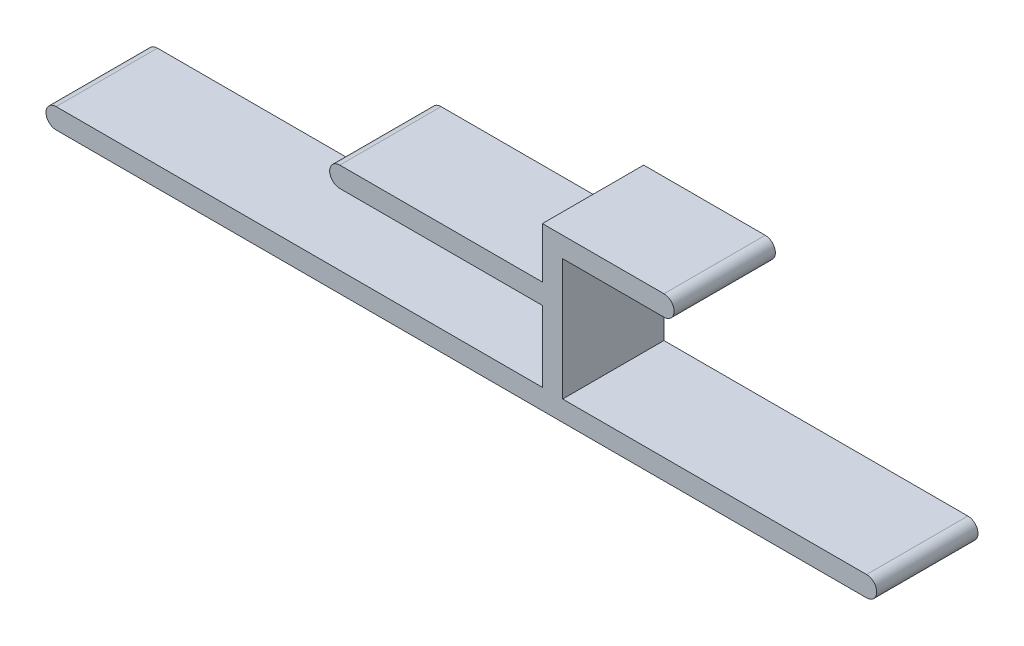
ISO-10303-21;
HEADER;
FILE_DESCRIPTION(('STEP AP214'),'2;1');
FILE_NAME('part.step','',(''),(''),'','','');
FILE_SCHEMA(('AUTOMOTIVE_DESIGN { 1 0 10303 214 1 1 1 1 }'));
ENDSEC;
DATA;
#1=APPLICATION_CONTEXT('core data for automotive mechanical design processes');
#2=APPLICATION_PROTOCOL_DEFINITION('international standard','automotive_design',2000,#1);
#3=PRODUCT_CONTEXT('',#1,'mechanical');
#4=PRODUCT('Part','Part','',(#3));
#5=PRODUCT_RELATED_PRODUCT_CATEGORY('part','',(#4));
#6=PRODUCT_DEFINITION_FORMATION('','',#4);
#7=PRODUCT_DEFINITION_CONTEXT('part definition',#1,'design');
#8=PRODUCT_DEFINITION('design','',#6,#7);
#9=PRODUCT_DEFINITION_SHAPE('','',#8);
#10=(LENGTH_UNIT() NAMED_UNIT(*) SI_UNIT(.MILLI.,.METRE.));
#11=(NAMED_UNIT(*) PLANE_ANGLE_UNIT() SI_UNIT($,.RADIAN.));
#12=(NAMED_UNIT(*) SI_UNIT($,.STERADIAN.) SOLID_ANGLE_UNIT());
#13=UNCERTAINTY_MEASURE_WITH_UNIT(LENGTH_MEASURE(1.E-05),#10,'distance_accuracy_value','');
#14=(GEOMETRIC_REPRESENTATION_CONTEXT(3) GLOBAL_UNCERTAINTY_ASSIGNED_CONTEXT((#13)) GLOBAL_UNIT_ASSIGNED_CONTEXT((#10,
#11,#12)) REPRESENTATION_CONTEXT('',''));
#15=CARTESIAN_POINT('',(0.,0.,0.));
#16=DIRECTION('',(0.,0.,1.));
#17=DIRECTION('',(1.,0.,0.));
#18=AXIS2_PLACEMENT_3D('',#15,#16,#17);
#19=CARTESIAN_POINT('',(-50.,-1.,10.));
#20=DIRECTION('',(0.,0.,-1.));
#21=DIRECTION('',(-1.,0.,0.));
#22=AXIS2_PLACEMENT_3D('',#19,#20,#21);
#23=CYLINDRICAL_SURFACE('',#22,1.);
#24=CARTESIAN_POINT('',(-50.,-1.,0.));
#25=DIRECTION('',(0.,0.,1.));
#26=DIRECTION('',(1.,0.,0.));
#27=AXIS2_PLACEMENT_3D('',#24,#25,#26);
#28=CIRCLE('',#27,1.);
#29=CARTESIAN_POINT('',(-50.,0.,0.));
#30=VERTEX_POINT('',#29);
#31=CARTESIAN_POINT('',(-50.,-2.,0.));
#32=VERTEX_POINT('',#31);
#33=EDGE_CURVE('E167',#30,#32,#28,.T.);
#34=ORIENTED_EDGE('',*,*,#33,.T.);
#35=DIRECTION('',(0.,0.,-1.));
#36=VECTOR('',#35,1.);
#37=CARTESIAN_POINT('',(-50.,-2.,10.));
#38=LINE('',#37,#36);
#39=CARTESIAN_POINT('',(-50.,-2.,10.));
#40=VERTEX_POINT('',#39);
#41=EDGE_CURVE('E11',#40,#32,#38,.T.);
#42=ORIENTED_EDGE('',*,*,#41,.F.);
#43=CARTESIAN_POINT('',(-50.,-1.,10.));
#44=DIRECTION('',(0.,0.,1.));
#45=DIRECTION('',(1.,0.,0.));
#46=AXIS2_PLACEMENT_3D('',#43,#44,#45);
#47=CIRCLE('',#46,1.);
#48=CARTESIAN_POINT('',(-50.,0.,10.));
#49=VERTEX_POINT('',#48);
#50=EDGE_CURVE('E193',#49,#40,#47,.T.);
#51=ORIENTED_EDGE('',*,*,#50,.F.);
#52=DIRECTION('',(0.,0.,-1.));
#53=VECTOR('',#52,1.);
#54=CARTESIAN_POINT('',(-50.,0.,10.));
#55=LINE('',#54,#53);
#56=EDGE_CURVE('E163',#49,#30,#55,.T.);
#57=ORIENTED_EDGE('',*,*,#56,.T.);
#58=EDGE_LOOP('',(#34,#42,#51,#57));
#59=FACE_BOUND('',#58,.T.);
#60=ADVANCED_FACE('F35',(#59),#23,.T.);
#61=CARTESIAN_POINT('',(-50.,-2.,10.));
#62=DIRECTION('',(0.,1.,0.));
#63=DIRECTION('',(0.,0.,1.));
#64=AXIS2_PLACEMENT_3D('',#61,#62,#63);
#65=PLANE('',#64);
#66=DIRECTION('',(1.,0.,0.));
#67=VECTOR('',#66,1.);
#68=CARTESIAN_POINT('',(-50.,-2.,0.));
#69=LINE('',#68,#67);
#70=CARTESIAN_POINT('',(30.,-2.,0.));
#71=VERTEX_POINT('',#70);
#72=EDGE_CURVE('E170',#32,#71,#69,.T.);
#73=ORIENTED_EDGE('',*,*,#72,.T.);
#74=DIRECTION('',(0.,0.,-1.));
#75=VECTOR('',#74,1.);
#76=CARTESIAN_POINT('',(30.,-2.,10.));
#77=LINE('',#76,#75);
#78=CARTESIAN_POINT('',(30.,-2.,10.));
#79=VERTEX_POINT('',#78);
#80=EDGE_CURVE('E43',#79,#71,#77,.T.);
#81=ORIENTED_EDGE('',*,*,#80,.F.);
#82=DIRECTION('',(1.,0.,0.));
#83=VECTOR('',#82,1.);
#84=CARTESIAN_POINT('',(-50.,-2.,10.));
#85=LINE('',#84,#83);
#86=EDGE_CURVE('E112',#40,#79,#85,.T.);
#87=ORIENTED_EDGE('',*,*,#86,.F.);
#88=ORIENTED_EDGE('',*,*,#41,.T.);
#89=EDGE_LOOP('',(#73,#81,#87,#88));
#90=FACE_BOUND('',#89,.T.);
#91=ADVANCED_FACE('F281',(#90),#65,.F.);
#92=CARTESIAN_POINT('',(30.,-0.999999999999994,10.));
#93=DIRECTION('',(0.,0.,-1.));
#94=DIRECTION('',(-1.,0.,0.));
#95=AXIS2_PLACEMENT_3D('',#92,#93,#94);
#96=CYLINDRICAL_SURFACE('',#95,1.00000000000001);
#97=CARTESIAN_POINT('',(30.,-0.999999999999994,0.));
#98=DIRECTION('',(0.,0.,1.));
#99=DIRECTION('',(-1.,0.,0.));
#100=AXIS2_PLACEMENT_3D('',#97,#98,#99);
#101=CIRCLE('',#100,1.00000000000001);
#102=CARTESIAN_POINT('',(30.,0.,0.));
#103=VERTEX_POINT('',#102);
#104=EDGE_CURVE('E172',#71,#103,#101,.T.);
#105=ORIENTED_EDGE('',*,*,#104,.T.);
#106=DIRECTION('',(0.,0.,-1.));
#107=VECTOR('',#106,1.);
#108=CARTESIAN_POINT('',(30.,0.,10.));
#109=LINE('',#108,#107);
#110=CARTESIAN_POINT('',(30.,0.,10.));
#111=VERTEX_POINT('',#110);
#112=EDGE_CURVE('E218',#111,#103,#109,.T.);
#113=ORIENTED_EDGE('',*,*,#112,.F.);
#114=CARTESIAN_POINT('',(30.,-0.999999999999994,10.));
#115=DIRECTION('',(0.,0.,1.));
#116=DIRECTION('',(-1.,0.,0.));
#117=AXIS2_PLACEMENT_3D('',#114,#115,#116);
#118=CIRCLE('',#117,1.00000000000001);
#119=EDGE_CURVE('E226',#79,#111,#118,.T.);
#120=ORIENTED_EDGE('',*,*,#119,.F.);
#121=ORIENTED_EDGE('',*,*,#80,.T.);
#122=EDGE_LOOP('',(#105,#113,#120,#121));
#123=FACE_BOUND('',#122,.T.);
#124=ADVANCED_FACE('F224',(#123),#96,.T.);
#125=CARTESIAN_POINT('',(0.,0.,10.));
#126=DIRECTION('',(0.,-1.,0.));
#127=DIRECTION('',(1.,0.,0.));
#128=AXIS2_PLACEMENT_3D('',#125,#126,#127);
#129=PLANE('',#128);
#130=DIRECTION('',(-1.,0.,0.));
#131=VECTOR('',#130,1.);
#132=CARTESIAN_POINT('',(0.,0.,0.));
#133=LINE('',#132,#131);
#134=CARTESIAN_POINT('',(0.,0.,0.));
#135=VERTEX_POINT('',#134);
#136=EDGE_CURVE('E174',#103,#135,#133,.T.);
#137=ORIENTED_EDGE('',*,*,#136,.T.);
#138=DIRECTION('',(0.,0.,-1.));
#139=VECTOR('',#138,1.);
#140=CARTESIAN_POINT('',(0.,0.,10.));
#141=LINE('',#140,#139);
#142=CARTESIAN_POINT('',(0.,0.,10.));
#143=VERTEX_POINT('',#142);
#144=EDGE_CURVE('E215',#143,#135,#141,.T.);
#145=ORIENTED_EDGE('',*,*,#144,.F.);
#146=DIRECTION('',(-1.,0.,0.));
#147=VECTOR('',#146,1.);
#148=CARTESIAN_POINT('',(0.,0.,10.));
#149=LINE('',#148,#147);
#150=EDGE_CURVE('E244',#111,#143,#149,.T.);
#151=ORIENTED_EDGE('',*,*,#150,.F.);
#152=ORIENTED_EDGE('',*,*,#112,.T.);
#153=EDGE_LOOP('',(#137,#145,#151,#152));
#154=FACE_BOUND('',#153,.T.);
#155=ADVANCED_FACE('F235',(#154),#129,.F.);
#156=CARTESIAN_POINT('',(0.,0.,10.));
#157=DIRECTION('',(-1.,0.,0.));
#158=DIRECTION('',(0.,0.,1.));
#159=AXIS2_PLACEMENT_3D('',#156,#157,#158);
#160=PLANE('',#159);
#161=DIRECTION('',(0.,1.,0.));
#162=VECTOR('',#161,1.);
#163=CARTESIAN_POINT('',(0.,0.,0.));
#164=LINE('',#163,#162);
#165=CARTESIAN_POINT('',(0.,12.,0.));
#166=VERTEX_POINT('',#165);
#167=EDGE_CURVE('E176',#135,#166,#164,.T.);
#168=ORIENTED_EDGE('',*,*,#167,.T.);
#169=DIRECTION('',(0.,0.,-1.));
#170=VECTOR('',#169,1.);
#171=CARTESIAN_POINT('',(0.,12.,10.));
#172=LINE('',#171,#170);
#173=CARTESIAN_POINT('',(0.,12.,10.));
#174=VERTEX_POINT('',#173);
#175=EDGE_CURVE('E212',#174,#166,#172,.T.);
#176=ORIENTED_EDGE('',*,*,#175,.F.);
#177=DIRECTION('',(0.,1.,0.));
#178=VECTOR('',#177,1.);
#179=CARTESIAN_POINT('',(0.,0.,10.));
#180=LINE('',#179,#178);
#181=EDGE_CURVE('E241',#143,#174,#180,.T.);
#182=ORIENTED_EDGE('',*,*,#181,.F.);
#183=ORIENTED_EDGE('',*,*,#144,.T.);
#184=EDGE_LOOP('',(#168,#176,#182,#183));
#185=FACE_BOUND('',#184,.T.);
#186=ADVANCED_FACE('F239',(#185),#160,.F.);
#187=CARTESIAN_POINT('',(0.,12.,10.));
#188=DIRECTION('',(0.,1.,0.));
#189=DIRECTION('',(0.,0.,1.));
#190=AXIS2_PLACEMENT_3D('',#187,#188,#189);
#191=PLANE('',#190);
#192=DIRECTION('',(1.,0.,0.));
#193=VECTOR('',#192,1.);
#194=CARTESIAN_POINT('',(0.,12.,0.));
#195=LINE('',#194,#193);
#196=CARTESIAN_POINT('',(10.,12.,0.));
#197=VERTEX_POINT('',#196);
#198=EDGE_CURVE('E178',#166,#197,#195,.T.);
#199=ORIENTED_EDGE('',*,*,#198,.T.);
#200=DIRECTION('',(0.,0.,-1.));
#201=VECTOR('',#200,1.);
#202=CARTESIAN_POINT('',(10.,12.,10.));
#203=LINE('',#202,#201);
#204=CARTESIAN_POINT('',(10.,12.,10.));
#205=VERTEX_POINT('',#204);
#206=EDGE_CURVE('E209',#205,#197,#203,.T.);
#207=ORIENTED_EDGE('',*,*,#206,.F.);
#208=DIRECTION('',(1.,0.,0.));
#209=VECTOR('',#208,1.);
#210=CARTESIAN_POINT('',(0.,12.,10.));
#211=LINE('',#210,#209);
#212=EDGE_CURVE('E243',#174,#205,#211,.T.);
#213=ORIENTED_EDGE('',*,*,#212,.F.);
#214=ORIENTED_EDGE('',*,*,#175,.T.);
#215=EDGE_LOOP('',(#199,#207,#213,#214));
#216=FACE_BOUND('',#215,.T.);
#217=ADVANCED_FACE('F294',(#216),#191,.F.);
#218=CARTESIAN_POINT('',(10.,13.,10.));
#219=DIRECTION('',(0.,0.,-1.));
#220=DIRECTION('',(-1.,0.,0.));
#221=AXIS2_PLACEMENT_3D('',#218,#219,#220);
#222=CYLINDRICAL_SURFACE('',#221,1.);
#223=CARTESIAN_POINT('',(10.,13.,0.));
#224=DIRECTION('',(0.,0.,1.));
#225=DIRECTION('',(1.,0.,0.));
#226=AXIS2_PLACEMENT_3D('',#223,#224,#225);
#227=CIRCLE('',#226,1.);
#228=CARTESIAN_POINT('',(10.,14.,0.));
#229=VERTEX_POINT('',#228);
#230=EDGE_CURVE('E180',#197,#229,#227,.T.);
#231=ORIENTED_EDGE('',*,*,#230,.T.);
#232=DIRECTION('',(0.,0.,-1.));
#233=VECTOR('',#232,1.);
#234=CARTESIAN_POINT('',(10.,14.,10.));
#235=LINE('',#234,#233);
#236=CARTESIAN_POINT('',(10.,14.,10.));
#237=VERTEX_POINT('',#236);
#238=EDGE_CURVE('E206',#237,#229,#235,.T.);
#239=ORIENTED_EDGE('',*,*,#238,.F.);
#240=CARTESIAN_POINT('',(10.,13.,10.));
#241=DIRECTION('',(0.,0.,1.));
#242=DIRECTION('',(1.,0.,0.));
#243=AXIS2_PLACEMENT_3D('',#240,#241,#242);
#244=CIRCLE('',#243,1.);
#245=EDGE_CURVE('E246',#205,#237,#244,.T.);
#246=ORIENTED_EDGE('',*,*,#245,.F.);
#247=ORIENTED_EDGE('',*,*,#206,.T.);
#248=EDGE_LOOP('',(#231,#239,#246,#247));
#249=FACE_BOUND('',#248,.T.);
#250=ADVANCED_FACE('F297',(#249),#222,.T.);
#251=CARTESIAN_POINT('',(-2.,14.,10.));
#252=DIRECTION('',(0.,-1.,0.));
#253=DIRECTION('',(0.,0.,-1.));
#254=AXIS2_PLACEMENT_3D('',#251,#252,#253);
#255=PLANE('',#254);
#256=DIRECTION('',(-1.,0.,0.));
#257=VECTOR('',#256,1.);
#258=CARTESIAN_POINT('',(-2.,14.,0.));
#259=LINE('',#258,#257);
#260=CARTESIAN_POINT('',(-2.,14.,0.));
#261=VERTEX_POINT('',#260);
#262=EDGE_CURVE('E182',#229,#261,#259,.T.);
#263=ORIENTED_EDGE('',*,*,#262,.T.);
#264=DIRECTION('',(0.,0.,-1.));
#265=VECTOR('',#264,1.);
#266=CARTESIAN_POINT('',(-2.,14.,10.));
#267=LINE('',#266,#265);
#268=CARTESIAN_POINT('',(-2.,14.,10.));
#269=VERTEX_POINT('',#268);
#270=EDGE_CURVE('E203',#269,#261,#267,.T.);
#271=ORIENTED_EDGE('',*,*,#270,.F.);
#272=DIRECTION('',(-1.,0.,0.));
#273=VECTOR('',#272,1.);
#274=CARTESIAN_POINT('',(-2.,14.,10.));
#275=LINE('',#274,#273);
#276=EDGE_CURVE('E252',#237,#269,#275,.T.);
#277=ORIENTED_EDGE('',*,*,#276,.F.);
#278=ORIENTED_EDGE('',*,*,#238,.T.);
#279=EDGE_LOOP('',(#263,#271,#277,#278));
#280=FACE_BOUND('',#279,.T.);
#281=ADVANCED_FACE('F301',(#280),#255,.F.);
#282=CARTESIAN_POINT('',(-2.,9.,10.));
#283=DIRECTION('',(1.,0.,0.));
#284=DIRECTION('',(0.,1.,0.));
#285=AXIS2_PLACEMENT_3D('',#282,#283,#284);
#286=PLANE('',#285);
#287=DIRECTION('',(0.,-1.,0.));
#288=VECTOR('',#287,1.);
#289=CARTESIAN_POINT('',(-2.,9.,0.));
#290=LINE('',#289,#288);
#291=CARTESIAN_POINT('',(-2.,9.,0.));
#292=VERTEX_POINT('',#291);
#293=EDGE_CURVE('E184',#261,#292,#290,.T.);
#294=ORIENTED_EDGE('',*,*,#293,.T.);
#295=DIRECTION('',(0.,0.,-1.));
#296=VECTOR('',#295,1.);
#297=CARTESIAN_POINT('',(-2.,9.,10.));
#298=LINE('',#297,#296);
#299=CARTESIAN_POINT('',(-2.,9.,10.));
#300=VERTEX_POINT('',#299);
#301=EDGE_CURVE('E200',#300,#292,#298,.T.);
#302=ORIENTED_EDGE('',*,*,#301,.F.);
#303=DIRECTION('',(0.,-1.,0.));
#304=VECTOR('',#303,1.);
#305=CARTESIAN_POINT('',(-2.,9.,10.));
#306=LINE('',#305,#304);
#307=EDGE_CURVE('E254',#269,#300,#306,.T.);
#308=ORIENTED_EDGE('',*,*,#307,.F.);
#309=ORIENTED_EDGE('',*,*,#270,.T.);
#310=EDGE_LOOP('',(#294,#302,#308,#309));
#311=FACE_BOUND('',#310,.T.);
#312=ADVANCED_FACE('F305',(#311),#286,.F.);
#313=CARTESIAN_POINT('',(-22.,9.,10.));
#314=DIRECTION('',(0.,-1.,0.));
#315=DIRECTION('',(0.,0.,-1.));
#316=AXIS2_PLACEMENT_3D('',#313,#314,#315);
#317=PLANE('',#316);
#318=DIRECTION('',(-1.,0.,0.));
#319=VECTOR('',#318,1.);
#320=CARTESIAN_POINT('',(-22.,9.,0.));
#321=LINE('',#320,#319);
#322=CARTESIAN_POINT('',(-22.,9.,0.));
#323=VERTEX_POINT('',#322);
#324=EDGE_CURVE('E186',#292,#323,#321,.T.);
#325=ORIENTED_EDGE('',*,*,#324,.T.);
#326=DIRECTION('',(0.,0.,-1.));
#327=VECTOR('',#326,1.);
#328=CARTESIAN_POINT('',(-22.,9.,10.));
#329=LINE('',#328,#327);
#330=CARTESIAN_POINT('',(-22.,9.,10.));
#331=VERTEX_POINT('',#330);
#332=EDGE_CURVE('E197',#331,#323,#329,.T.);
#333=ORIENTED_EDGE('',*,*,#332,.F.);
#334=DIRECTION('',(-1.,0.,0.));
#335=VECTOR('',#334,1.);
#336=CARTESIAN_POINT('',(-22.,9.,10.));
#337=LINE('',#336,#335);
#338=EDGE_CURVE('E256',#300,#331,#337,.T.);
#339=ORIENTED_EDGE('',*,*,#338,.F.);
#340=ORIENTED_EDGE('',*,*,#301,.T.);
#341=EDGE_LOOP('',(#325,#333,#339,#340));
#342=FACE_BOUND('',#341,.T.);
#343=ADVANCED_FACE('F262',(#342),#317,.F.);
#344=CARTESIAN_POINT('',(-22.,8.,10.));
#345=DIRECTION('',(0.,0.,-1.));
#346=DIRECTION('',(-1.,0.,0.));
#347=AXIS2_PLACEMENT_3D('',#344,#345,#346);
#348=CYLINDRICAL_SURFACE('',#347,1.);
#349=CARTESIAN_POINT('',(-22.,8.,0.));
#350=DIRECTION('',(0.,0.,1.));
#351=DIRECTION('',(-1.,0.,0.));
#352=AXIS2_PLACEMENT_3D('',#349,#350,#351);
#353=CIRCLE('',#352,1.);
#354=CARTESIAN_POINT('',(-22.,7.,0.));
#355=VERTEX_POINT('',#354);
#356=EDGE_CURVE('E188',#323,#355,#353,.T.);
#357=ORIENTED_EDGE('',*,*,#356,.T.);
#358=DIRECTION('',(0.,0.,-1.));
#359=VECTOR('',#358,1.);
#360=CARTESIAN_POINT('',(-22.,7.,10.));
#361=LINE('',#360,#359);
#362=CARTESIAN_POINT('',(-22.,7.,10.));
#363=VERTEX_POINT('',#362);
#364=EDGE_CURVE('E158',#363,#355,#361,.T.);
#365=ORIENTED_EDGE('',*,*,#364,.F.);
#366=CARTESIAN_POINT('',(-22.,8.,10.));
#367=DIRECTION('',(0.,0.,1.));
#368=DIRECTION('',(-1.,0.,0.));
#369=AXIS2_PLACEMENT_3D('',#366,#367,#368);
#370=CIRCLE('',#369,1.);
#371=EDGE_CURVE('E149',#331,#363,#370,.T.);
#372=ORIENTED_EDGE('',*,*,#371,.F.);
#373=ORIENTED_EDGE('',*,*,#332,.T.);
#374=EDGE_LOOP('',(#357,#365,#372,#373));
#375=FACE_BOUND('',#374,.T.);
#376=ADVANCED_FACE('F266',(#375),#348,.T.);
#377=CARTESIAN_POINT('',(-22.,7.,10.));
#378=DIRECTION('',(0.,1.,0.));
#379=DIRECTION('',(0.,0.,1.));
#380=AXIS2_PLACEMENT_3D('',#377,#378,#379);
#381=PLANE('',#380);
#382=DIRECTION('',(1.,0.,0.));
#383=VECTOR('',#382,1.);
#384=CARTESIAN_POINT('',(-22.,7.,0.));
#385=LINE('',#384,#383);
#386=CARTESIAN_POINT('',(-2.,7.,0.));
#387=VERTEX_POINT('',#386);
#388=EDGE_CURVE('E157',#355,#387,#385,.T.);
#389=ORIENTED_EDGE('',*,*,#388,.T.);
#390=DIRECTION('',(0.,0.,-1.));
#391=VECTOR('',#390,1.);
#392=CARTESIAN_POINT('',(-2.,7.,10.));
#393=LINE('',#392,#391);
#394=CARTESIAN_POINT('',(-2.,7.,10.));
#395=VERTEX_POINT('',#394);
#396=EDGE_CURVE('E154',#395,#387,#393,.T.);
#397=ORIENTED_EDGE('',*,*,#396,.F.);
#398=DIRECTION('',(1.,0.,0.));
#399=VECTOR('',#398,1.);
#400=CARTESIAN_POINT('',(-22.,7.,10.));
#401=LINE('',#400,#399);
#402=EDGE_CURVE('E143',#363,#395,#401,.T.);
#403=ORIENTED_EDGE('',*,*,#402,.F.);
#404=ORIENTED_EDGE('',*,*,#364,.T.);
#405=EDGE_LOOP('',(#389,#397,#403,#404));
#406=FACE_BOUND('',#405,.T.);
#407=ADVANCED_FACE('F155',(#406),#381,.F.);
#408=CARTESIAN_POINT('',(-2.,0.,10.));
#409=DIRECTION('',(1.,0.,0.));
#410=DIRECTION('',(0.,1.,0.));
#411=AXIS2_PLACEMENT_3D('',#408,#409,#410);
#412=PLANE('',#411);
#413=DIRECTION('',(0.,-1.,0.));
#414=VECTOR('',#413,1.);
#415=CARTESIAN_POINT('',(-2.,0.,0.));
#416=LINE('',#415,#414);
#417=CARTESIAN_POINT('',(-2.,0.,0.));
#418=VERTEX_POINT('',#417);
#419=EDGE_CURVE('E98',#387,#418,#416,.T.);
#420=ORIENTED_EDGE('',*,*,#419,.T.);
#421=DIRECTION('',(0.,0.,-1.));
#422=VECTOR('',#421,1.);
#423=CARTESIAN_POINT('',(-2.,0.,10.));
#424=LINE('',#423,#422);
#425=CARTESIAN_POINT('',(-2.,0.,10.));
#426=VERTEX_POINT('',#425);
#427=EDGE_CURVE('E159',#426,#418,#424,.T.);
#428=ORIENTED_EDGE('',*,*,#427,.F.);
#429=DIRECTION('',(0.,-1.,0.));
#430=VECTOR('',#429,1.);
#431=CARTESIAN_POINT('',(-2.,0.,10.));
#432=LINE('',#431,#430);
#433=EDGE_CURVE('E147',#395,#426,#432,.T.);
#434=ORIENTED_EDGE('',*,*,#433,.F.);
#435=ORIENTED_EDGE('',*,*,#396,.T.);
#436=EDGE_LOOP('',(#420,#428,#434,#435));
#437=FACE_BOUND('',#436,.T.);
#438=ADVANCED_FACE('F161',(#437),#412,.F.);
#439=CARTESIAN_POINT('',(-50.,0.,10.));
#440=DIRECTION('',(0.,-1.,0.));
#441=DIRECTION('',(0.,0.,-1.));
#442=AXIS2_PLACEMENT_3D('',#439,#440,#441);
#443=PLANE('',#442);
#444=DIRECTION('',(-1.,0.,0.));
#445=VECTOR('',#444,1.);
#446=CARTESIAN_POINT('',(-50.,0.,0.));
#447=LINE('',#446,#445);
#448=EDGE_CURVE('E104',#418,#30,#447,.T.);
#449=ORIENTED_EDGE('',*,*,#448,.T.);
#450=ORIENTED_EDGE('',*,*,#56,.F.);
#451=DIRECTION('',(-1.,0.,0.));
#452=VECTOR('',#451,1.);
#453=CARTESIAN_POINT('',(-50.,0.,10.));
#454=LINE('',#453,#452);
#455=EDGE_CURVE('E51',#426,#49,#454,.T.);
#456=ORIENTED_EDGE('',*,*,#455,.F.);
#457=ORIENTED_EDGE('',*,*,#427,.T.);
#458=EDGE_LOOP('',(#449,#450,#456,#457));
#459=FACE_BOUND('',#458,.T.);
#460=ADVANCED_FACE('F270',(#459),#443,.F.);
#461=CARTESIAN_POINT('',(-50.,-1.,10.));
#462=DIRECTION('',(0.,0.,1.));
#463=DIRECTION('',(1.,0.,0.));
#464=AXIS2_PLACEMENT_3D('',#461,#462,#463);
#465=PLANE('',#464);
#466=ORIENTED_EDGE('',*,*,#50,.T.);
#467=ORIENTED_EDGE('',*,*,#86,.T.);
#468=ORIENTED_EDGE('',*,*,#119,.T.);
#469=ORIENTED_EDGE('',*,*,#150,.T.);
#470=ORIENTED_EDGE('',*,*,#181,.T.);
#471=ORIENTED_EDGE('',*,*,#212,.T.);
#472=ORIENTED_EDGE('',*,*,#245,.T.);
#473=ORIENTED_EDGE('',*,*,#276,.T.);
#474=ORIENTED_EDGE('',*,*,#307,.T.);
#475=ORIENTED_EDGE('',*,*,#338,.T.);
#476=ORIENTED_EDGE('',*,*,#371,.T.);
#477=ORIENTED_EDGE('',*,*,#402,.T.);
#478=ORIENTED_EDGE('',*,*,#433,.T.);
#479=ORIENTED_EDGE('',*,*,#455,.T.);
#480=EDGE_LOOP('',(#466,#467,#468,#469,#470,#471,#472,#473,#474,#475,#476,#477,#478,#479));
#481=FACE_BOUND('',#480,.T.);
#482=ADVANCED_FACE('F145',(#481),#465,.T.);
#483=CARTESIAN_POINT('',(-50.,-1.,0.));
#484=DIRECTION('',(0.,0.,1.));
#485=DIRECTION('',(1.,0.,0.));
#486=AXIS2_PLACEMENT_3D('',#483,#484,#485);
#487=PLANE('',#486);
#488=ORIENTED_EDGE('',*,*,#33,.F.);
#489=ORIENTED_EDGE('',*,*,#448,.F.);
#490=ORIENTED_EDGE('',*,*,#419,.F.);
#491=ORIENTED_EDGE('',*,*,#388,.F.);
#492=ORIENTED_EDGE('',*,*,#356,.F.);
#493=ORIENTED_EDGE('',*,*,#324,.F.);
#494=ORIENTED_EDGE('',*,*,#293,.F.);
#495=ORIENTED_EDGE('',*,*,#262,.F.);
#496=ORIENTED_EDGE('',*,*,#230,.F.);
#497=ORIENTED_EDGE('',*,*,#198,.F.);
#498=ORIENTED_EDGE('',*,*,#167,.F.);
#499=ORIENTED_EDGE('',*,*,#136,.F.);
#500=ORIENTED_EDGE('',*,*,#104,.F.);
#501=ORIENTED_EDGE('',*,*,#72,.F.);
#502=EDGE_LOOP('',(#488,#489,#490,#491,#492,#493,#494,#495,#496,#497,#498,#499,#500,#501));
#503=FACE_BOUND('',#502,.T.);
#504=ADVANCED_FACE('F230',(#503),#487,.F.);
#505=CLOSED_SHELL('',(#60,#91,#124,#155,#186,#217,#250,#281,#312,#343,#376,#407,#438,#460,#482,#504));
#506=MANIFOLD_SOLID_BREP('B2',#505);
#507=ADVANCED_BREP_SHAPE_REPRESENTATION('',(#18,#506),#14);
#508=SHAPE_DEFINITION_REPRESENTATION(#9,#507);
ENDSEC;
END-ISO-10303-21;
